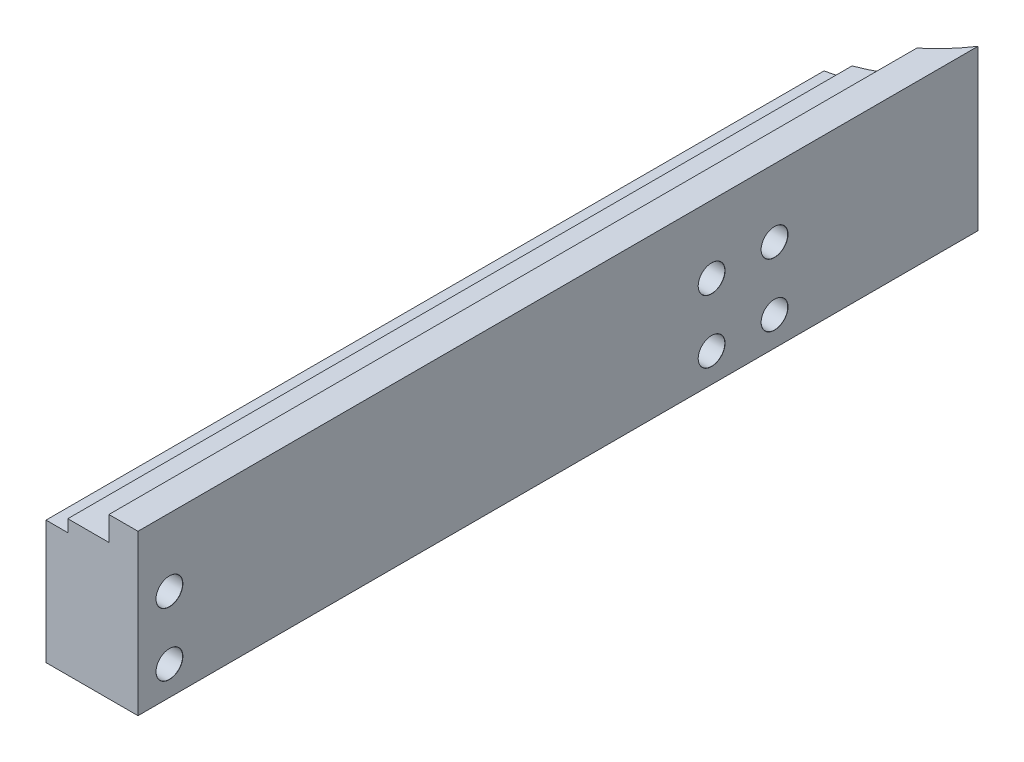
ISO-10303-21;
HEADER;
FILE_DESCRIPTION(('STEP AP214'),'2;1');
FILE_NAME('part.step','',(''),(''),'','','');
FILE_SCHEMA(('AUTOMOTIVE_DESIGN { 1 0 10303 214 1 1 1 1 }'));
ENDSEC;
DATA;
#1=APPLICATION_CONTEXT('core data for automotive mechanical design processes');
#2=APPLICATION_PROTOCOL_DEFINITION('international standard','automotive_design',2000,#1);
#3=PRODUCT_CONTEXT('',#1,'mechanical');
#4=PRODUCT('Part','Part','',(#3));
#5=PRODUCT_RELATED_PRODUCT_CATEGORY('part','',(#4));
#6=PRODUCT_DEFINITION_FORMATION('','',#4);
#7=PRODUCT_DEFINITION_CONTEXT('part definition',#1,'design');
#8=PRODUCT_DEFINITION('design','',#6,#7);
#9=PRODUCT_DEFINITION_SHAPE('','',#8);
#10=(LENGTH_UNIT() NAMED_UNIT(*) SI_UNIT(.MILLI.,.METRE.));
#11=(NAMED_UNIT(*) PLANE_ANGLE_UNIT() SI_UNIT($,.RADIAN.));
#12=(NAMED_UNIT(*) SI_UNIT($,.STERADIAN.) SOLID_ANGLE_UNIT());
#13=UNCERTAINTY_MEASURE_WITH_UNIT(LENGTH_MEASURE(1.E-05),#10,'distance_accuracy_value','');
#14=(GEOMETRIC_REPRESENTATION_CONTEXT(3) GLOBAL_UNCERTAINTY_ASSIGNED_CONTEXT((#13)) GLOBAL_UNIT_ASSIGNED_CONTEXT((#10,
#11,#12)) REPRESENTATION_CONTEXT('',''));
#15=CARTESIAN_POINT('',(0.,0.,0.));
#16=DIRECTION('',(0.,0.,1.));
#17=DIRECTION('',(1.,0.,0.));
#18=AXIS2_PLACEMENT_3D('',#15,#16,#17);
#19=CARTESIAN_POINT('',(-165.,251.054588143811,280.));
#20=DIRECTION('',(1.,0.,0.));
#21=DIRECTION('',(0.,0.,-1.));
#22=AXIS2_PLACEMENT_3D('',#19,#20,#21);
#23=PLANE('',#22);
#24=DIRECTION('',(0.,-1.,0.));
#25=VECTOR('',#24,1.);
#26=CARTESIAN_POINT('',(-165.,278.054588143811,113.109028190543));
#27=LINE('',#26,#25);
#28=CARTESIAN_POINT('',(-165.,251.054588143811,113.109028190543));
#29=VERTEX_POINT('',#28);
#30=CARTESIAN_POINT('',(-165.,246.05458814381,113.109028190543));
#31=VERTEX_POINT('',#30);
#32=EDGE_CURVE('E126',#29,#31,#27,.T.);
#33=ORIENTED_EDGE('',*,*,#32,.T.);
#34=DIRECTION('',(0.,0.,1.));
#35=VECTOR('',#34,1.);
#36=CARTESIAN_POINT('',(-165.,246.05458814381,113.109028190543));
#37=LINE('',#36,#35);
#38=CARTESIAN_POINT('',(-165.,246.05458814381,280.));
#39=VERTEX_POINT('',#38);
#40=EDGE_CURVE('E41',#31,#39,#37,.T.);
#41=ORIENTED_EDGE('',*,*,#40,.T.);
#42=DIRECTION('',(0.,-1.,0.));
#43=VECTOR('',#42,1.);
#44=CARTESIAN_POINT('',(-165.,251.054588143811,280.));
#45=LINE('',#44,#43);
#46=CARTESIAN_POINT('',(-165.,251.054588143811,280.));
#47=VERTEX_POINT('',#46);
#48=EDGE_CURVE('E133',#47,#39,#45,.T.);
#49=ORIENTED_EDGE('',*,*,#48,.F.);
#50=DIRECTION('',(0.,0.,-1.));
#51=VECTOR('',#50,1.);
#52=CARTESIAN_POINT('',(-165.,251.054588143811,280.));
#53=LINE('',#52,#51);
#54=EDGE_CURVE('E98',#47,#29,#53,.T.);
#55=ORIENTED_EDGE('',*,*,#54,.T.);
#56=EDGE_LOOP('',(#33,#41,#49,#55));
#57=FACE_BOUND('',#56,.T.);
#58=ADVANCED_FACE('F16',(#57),#23,.F.);
#59=CARTESIAN_POINT('',(-178.,218.05458814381,280.));
#60=DIRECTION('',(1.,0.,0.));
#61=DIRECTION('',(0.,0.,-1.));
#62=AXIS2_PLACEMENT_3D('',#59,#60,#61);
#63=PLANE('',#62);
#64=CARTESIAN_POINT('',(-178.,224.05458814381,273.5));
#65=DIRECTION('',(-1.,0.,0.));
#66=DIRECTION('',(0.,0.,1.));
#67=AXIS2_PLACEMENT_3D('',#64,#65,#66);
#68=CIRCLE('',#67,5.025);
#69=CARTESIAN_POINT('',(-178.,224.05458814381,278.525));
#70=VERTEX_POINT('',#69);
#71=EDGE_CURVE('E266',#70,#70,#68,.T.);
#72=ORIENTED_EDGE('',*,*,#71,.F.);
#73=EDGE_LOOP('',(#72));
#74=FACE_BOUND('',#73,.T.);
#75=CARTESIAN_POINT('',(-178.,237.05458814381,273.5));
#76=DIRECTION('',(-1.,0.,0.));
#77=DIRECTION('',(0.,0.,1.));
#78=AXIS2_PLACEMENT_3D('',#75,#76,#77);
#79=CIRCLE('',#78,5.025);
#80=CARTESIAN_POINT('',(-178.,237.05458814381,278.525));
#81=VERTEX_POINT('',#80);
#82=EDGE_CURVE('E245',#81,#81,#79,.T.);
#83=ORIENTED_EDGE('',*,*,#82,.F.);
#84=EDGE_LOOP('',(#83));
#85=FACE_BOUND('',#84,.T.);
#86=CARTESIAN_POINT('',(-178.,224.05458814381,161.5));
#87=DIRECTION('',(-1.,0.,0.));
#88=DIRECTION('',(0.,0.,1.));
#89=AXIS2_PLACEMENT_3D('',#86,#87,#88);
#90=CIRCLE('',#89,5.025);
#91=CARTESIAN_POINT('',(-178.,224.05458814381,166.525));
#92=VERTEX_POINT('',#91);
#93=EDGE_CURVE('E224',#92,#92,#90,.T.);
#94=ORIENTED_EDGE('',*,*,#93,.F.);
#95=EDGE_LOOP('',(#94));
#96=FACE_BOUND('',#95,.T.);
#97=CARTESIAN_POINT('',(-178.,224.05458814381,148.5));
#98=DIRECTION('',(-1.,0.,0.));
#99=DIRECTION('',(0.,0.,1.));
#100=AXIS2_PLACEMENT_3D('',#97,#98,#99);
#101=CIRCLE('',#100,5.025);
#102=CARTESIAN_POINT('',(-178.,224.05458814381,153.525));
#103=VERTEX_POINT('',#102);
#104=EDGE_CURVE('E203',#103,#103,#101,.T.);
#105=ORIENTED_EDGE('',*,*,#104,.F.);
#106=EDGE_LOOP('',(#105));
#107=FACE_BOUND('',#106,.T.);
#108=CARTESIAN_POINT('',(-178.,237.05458814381,161.5));
#109=DIRECTION('',(-1.,0.,0.));
#110=DIRECTION('',(0.,0.,1.));
#111=AXIS2_PLACEMENT_3D('',#108,#109,#110);
#112=CIRCLE('',#111,5.025);
#113=CARTESIAN_POINT('',(-178.,237.05458814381,166.525));
#114=VERTEX_POINT('',#113);
#115=EDGE_CURVE('E182',#114,#114,#112,.T.);
#116=ORIENTED_EDGE('',*,*,#115,.F.);
#117=EDGE_LOOP('',(#116));
#118=FACE_BOUND('',#117,.T.);
#119=CARTESIAN_POINT('',(-178.,237.05458814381,148.5));
#120=DIRECTION('',(-1.,0.,0.));
#121=DIRECTION('',(0.,0.,1.));
#122=AXIS2_PLACEMENT_3D('',#119,#120,#121);
#123=CIRCLE('',#122,5.025);
#124=CARTESIAN_POINT('',(-178.,237.05458814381,153.525));
#125=VERTEX_POINT('',#124);
#126=EDGE_CURVE('E161',#125,#125,#123,.T.);
#127=ORIENTED_EDGE('',*,*,#126,.F.);
#128=EDGE_LOOP('',(#127));
#129=FACE_BOUND('',#128,.T.);
#130=DIRECTION('',(0.,0.,-1.));
#131=VECTOR('',#130,1.);
#132=CARTESIAN_POINT('',(-178.,243.55458814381,280.));
#133=LINE('',#132,#131);
#134=CARTESIAN_POINT('',(-178.,243.55458814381,280.));
#135=VERTEX_POINT('',#134);
#136=CARTESIAN_POINT('',(-178.,243.55458814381,119.286531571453));
#137=VERTEX_POINT('',#136);
#138=EDGE_CURVE('E124',#135,#137,#133,.T.);
#139=ORIENTED_EDGE('',*,*,#138,.T.);
#140=DIRECTION('',(0.,-1.,0.));
#141=VECTOR('',#140,1.);
#142=CARTESIAN_POINT('',(-178.,278.054588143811,119.286531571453));
#143=LINE('',#142,#141);
#144=CARTESIAN_POINT('',(-178.,218.05458814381,119.286531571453));
#145=VERTEX_POINT('',#144);
#146=EDGE_CURVE('E101',#137,#145,#143,.T.);
#147=ORIENTED_EDGE('',*,*,#146,.T.);
#148=DIRECTION('',(0.,0.,-1.));
#149=VECTOR('',#148,1.);
#150=CARTESIAN_POINT('',(-178.,218.05458814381,280.));
#151=LINE('',#150,#149);
#152=CARTESIAN_POINT('',(-178.,218.05458814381,280.));
#153=VERTEX_POINT('',#152);
#154=EDGE_CURVE('E121',#153,#145,#151,.T.);
#155=ORIENTED_EDGE('',*,*,#154,.F.);
#156=DIRECTION('',(0.,-1.,0.));
#157=VECTOR('',#156,1.);
#158=CARTESIAN_POINT('',(-178.,218.05458814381,280.));
#159=LINE('',#158,#157);
#160=EDGE_CURVE('E25',#135,#153,#159,.T.);
#161=ORIENTED_EDGE('',*,*,#160,.F.);
#162=EDGE_LOOP('',(#139,#147,#155,#161));
#163=FACE_BOUND('',#162,.T.);
#164=ADVANCED_FACE('F313',(#74,#85,#96,#107,#118,#129,#163),#63,.F.);
#165=CARTESIAN_POINT('',(-159.,218.05458814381,280.));
#166=DIRECTION('',(0.,1.,0.));
#167=DIRECTION('',(0.,0.,1.));
#168=AXIS2_PLACEMENT_3D('',#165,#166,#167);
#169=PLANE('',#168);
#170=ORIENTED_EDGE('',*,*,#154,.T.);
#171=CARTESIAN_POINT('',(-184.,218.05458814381,89.8926546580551));
#172=DIRECTION('',(0.,1.,0.));
#173=DIRECTION('',(0.,0.,1.));
#174=AXIS2_PLACEMENT_3D('',#171,#172,#173);
#175=CIRCLE('',#174,30.);
#176=CARTESIAN_POINT('',(-159.,218.05458814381,106.475778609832));
#177=VERTEX_POINT('',#176);
#178=EDGE_CURVE('E120',#145,#177,#175,.T.);
#179=ORIENTED_EDGE('',*,*,#178,.T.);
#180=DIRECTION('',(0.,0.,-1.));
#181=VECTOR('',#180,1.);
#182=CARTESIAN_POINT('',(-159.,218.05458814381,280.));
#183=LINE('',#182,#181);
#184=CARTESIAN_POINT('',(-159.,218.05458814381,280.));
#185=VERTEX_POINT('',#184);
#186=EDGE_CURVE('E117',#185,#177,#183,.T.);
#187=ORIENTED_EDGE('',*,*,#186,.F.);
#188=DIRECTION('',(1.,0.,0.));
#189=VECTOR('',#188,1.);
#190=CARTESIAN_POINT('',(-159.,218.05458814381,280.));
#191=LINE('',#190,#189);
#192=EDGE_CURVE('E11',#153,#185,#191,.T.);
#193=ORIENTED_EDGE('',*,*,#192,.F.);
#194=EDGE_LOOP('',(#170,#179,#187,#193));
#195=FACE_BOUND('',#194,.T.);
#196=ADVANCED_FACE('F316',(#195),#169,.F.);
#197=CARTESIAN_POINT('',(-159.,218.05458814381,280.));
#198=DIRECTION('',(-1.,0.,0.));
#199=DIRECTION('',(0.,0.,1.));
#200=AXIS2_PLACEMENT_3D('',#197,#198,#199);
#201=PLANE('',#200);
#202=CARTESIAN_POINT('',(-159.,224.05458814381,273.5));
#203=DIRECTION('',(-1.,0.,0.));
#204=DIRECTION('',(0.,0.,1.));
#205=AXIS2_PLACEMENT_3D('',#202,#203,#204);
#206=CIRCLE('',#205,2.775);
#207=CARTESIAN_POINT('',(-159.,224.05458814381,276.275));
#208=VERTEX_POINT('',#207);
#209=EDGE_CURVE('E269',#208,#208,#206,.T.);
#210=ORIENTED_EDGE('',*,*,#209,.T.);
#211=EDGE_LOOP('',(#210));
#212=FACE_BOUND('',#211,.T.);
#213=CARTESIAN_POINT('',(-159.,237.05458814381,273.5));
#214=DIRECTION('',(-1.,0.,0.));
#215=DIRECTION('',(0.,0.,1.));
#216=AXIS2_PLACEMENT_3D('',#213,#214,#215);
#217=CIRCLE('',#216,2.775);
#218=CARTESIAN_POINT('',(-159.,237.05458814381,276.275));
#219=VERTEX_POINT('',#218);
#220=EDGE_CURVE('E248',#219,#219,#217,.T.);
#221=ORIENTED_EDGE('',*,*,#220,.T.);
#222=EDGE_LOOP('',(#221));
#223=FACE_BOUND('',#222,.T.);
#224=CARTESIAN_POINT('',(-159.,224.05458814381,161.5));
#225=DIRECTION('',(-1.,0.,0.));
#226=DIRECTION('',(0.,0.,1.));
#227=AXIS2_PLACEMENT_3D('',#224,#225,#226);
#228=CIRCLE('',#227,2.775);
#229=CARTESIAN_POINT('',(-159.,224.05458814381,164.275));
#230=VERTEX_POINT('',#229);
#231=EDGE_CURVE('E227',#230,#230,#228,.T.);
#232=ORIENTED_EDGE('',*,*,#231,.T.);
#233=EDGE_LOOP('',(#232));
#234=FACE_BOUND('',#233,.T.);
#235=CARTESIAN_POINT('',(-159.,224.05458814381,148.5));
#236=DIRECTION('',(-1.,0.,0.));
#237=DIRECTION('',(0.,0.,1.));
#238=AXIS2_PLACEMENT_3D('',#235,#236,#237);
#239=CIRCLE('',#238,2.775);
#240=CARTESIAN_POINT('',(-159.,224.05458814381,151.275));
#241=VERTEX_POINT('',#240);
#242=EDGE_CURVE('E206',#241,#241,#239,.T.);
#243=ORIENTED_EDGE('',*,*,#242,.T.);
#244=EDGE_LOOP('',(#243));
#245=FACE_BOUND('',#244,.T.);
#246=CARTESIAN_POINT('',(-159.,237.05458814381,161.5));
#247=DIRECTION('',(-1.,0.,0.));
#248=DIRECTION('',(0.,0.,1.));
#249=AXIS2_PLACEMENT_3D('',#246,#247,#248);
#250=CIRCLE('',#249,2.775);
#251=CARTESIAN_POINT('',(-159.,237.05458814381,164.275));
#252=VERTEX_POINT('',#251);
#253=EDGE_CURVE('E185',#252,#252,#250,.T.);
#254=ORIENTED_EDGE('',*,*,#253,.T.);
#255=EDGE_LOOP('',(#254));
#256=FACE_BOUND('',#255,.T.);
#257=CARTESIAN_POINT('',(-159.,237.05458814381,148.5));
#258=DIRECTION('',(-1.,0.,0.));
#259=DIRECTION('',(0.,0.,1.));
#260=AXIS2_PLACEMENT_3D('',#257,#258,#259);
#261=CIRCLE('',#260,2.775);
#262=CARTESIAN_POINT('',(-159.,237.05458814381,151.275));
#263=VERTEX_POINT('',#262);
#264=EDGE_CURVE('E164',#263,#263,#261,.T.);
#265=ORIENTED_EDGE('',*,*,#264,.T.);
#266=EDGE_LOOP('',(#265));
#267=FACE_BOUND('',#266,.T.);
#268=ORIENTED_EDGE('',*,*,#186,.T.);
#269=DIRECTION('',(0.,-1.,0.));
#270=VECTOR('',#269,1.);
#271=CARTESIAN_POINT('',(-159.,278.054588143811,106.475778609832));
#272=LINE('',#271,#270);
#273=CARTESIAN_POINT('',(-159.,251.054588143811,106.475778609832));
#274=VERTEX_POINT('',#273);
#275=EDGE_CURVE('E114',#177,#274,#272,.F.);
#276=ORIENTED_EDGE('',*,*,#275,.T.);
#277=DIRECTION('',(0.,0.,-1.));
#278=VECTOR('',#277,1.);
#279=CARTESIAN_POINT('',(-159.,251.054588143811,280.));
#280=LINE('',#279,#278);
#281=CARTESIAN_POINT('',(-159.,251.054588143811,280.));
#282=VERTEX_POINT('',#281);
#283=EDGE_CURVE('E109',#282,#274,#280,.T.);
#284=ORIENTED_EDGE('',*,*,#283,.F.);
#285=DIRECTION('',(0.,1.,0.));
#286=VECTOR('',#285,1.);
#287=CARTESIAN_POINT('',(-159.,218.05458814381,280.));
#288=LINE('',#287,#286);
#289=EDGE_CURVE('E103',#185,#282,#288,.T.);
#290=ORIENTED_EDGE('',*,*,#289,.F.);
#291=EDGE_LOOP('',(#268,#276,#284,#290));
#292=FACE_BOUND('',#291,.T.);
#293=ADVANCED_FACE('F273',(#212,#223,#234,#245,#256,#267,#292),#201,.F.);
#294=CARTESIAN_POINT('',(-159.,251.054588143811,280.));
#295=DIRECTION('',(0.,-1.,0.));
#296=DIRECTION('',(0.,0.,-1.));
#297=AXIS2_PLACEMENT_3D('',#294,#295,#296);
#298=PLANE('',#297);
#299=ORIENTED_EDGE('',*,*,#283,.T.);
#300=CARTESIAN_POINT('',(-184.,251.054588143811,89.8926546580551));
#301=DIRECTION('',(0.,-1.,0.));
#302=DIRECTION('',(0.,0.,-1.));
#303=AXIS2_PLACEMENT_3D('',#300,#301,#302);
#304=CIRCLE('',#303,30.);
#305=EDGE_CURVE('E104',#274,#29,#304,.T.);
#306=ORIENTED_EDGE('',*,*,#305,.T.);
#307=ORIENTED_EDGE('',*,*,#54,.F.);
#308=DIRECTION('',(-1.,0.,0.));
#309=VECTOR('',#308,1.);
#310=CARTESIAN_POINT('',(-159.,251.054588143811,280.));
#311=LINE('',#310,#309);
#312=EDGE_CURVE('E106',#282,#47,#311,.T.);
#313=ORIENTED_EDGE('',*,*,#312,.F.);
#314=EDGE_LOOP('',(#299,#306,#307,#313));
#315=FACE_BOUND('',#314,.T.);
#316=ADVANCED_FACE('F337',(#315),#298,.F.);
#317=CARTESIAN_POINT('',(-178.,243.55458814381,280.));
#318=DIRECTION('',(0.,-1.,0.));
#319=DIRECTION('',(0.,0.,-1.));
#320=AXIS2_PLACEMENT_3D('',#317,#318,#319);
#321=PLANE('',#320);
#322=DIRECTION('',(-1.,0.,0.));
#323=VECTOR('',#322,1.);
#324=CARTESIAN_POINT('',(-178.,243.55458814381,280.));
#325=LINE('',#324,#323);
#326=CARTESIAN_POINT('',(-173.5,243.55458814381,280.));
#327=VERTEX_POINT('',#326);
#328=EDGE_CURVE('E33',#327,#135,#325,.T.);
#329=ORIENTED_EDGE('',*,*,#328,.F.);
#330=DIRECTION('',(0.,0.,1.));
#331=VECTOR('',#330,1.);
#332=CARTESIAN_POINT('',(-173.5,243.55458814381,113.109028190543));
#333=LINE('',#332,#331);
#334=CARTESIAN_POINT('',(-173.5,243.55458814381,117.995145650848));
#335=VERTEX_POINT('',#334);
#336=EDGE_CURVE('E87',#335,#327,#333,.T.);
#337=ORIENTED_EDGE('',*,*,#336,.F.);
#338=CARTESIAN_POINT('',(-184.,243.55458814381,89.8926546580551));
#339=DIRECTION('',(0.,-1.,0.));
#340=DIRECTION('',(0.,0.,-1.));
#341=AXIS2_PLACEMENT_3D('',#338,#339,#340);
#342=CIRCLE('',#341,30.);
#343=EDGE_CURVE('E20',#335,#137,#342,.T.);
#344=ORIENTED_EDGE('',*,*,#343,.T.);
#345=ORIENTED_EDGE('',*,*,#138,.F.);
#346=EDGE_LOOP('',(#329,#337,#344,#345));
#347=FACE_BOUND('',#346,.T.);
#348=ADVANCED_FACE('F96',(#347),#321,.F.);
#349=CARTESIAN_POINT('',(0.,0.,280.));
#350=DIRECTION('',(0.,0.,1.));
#351=DIRECTION('',(1.,0.,0.));
#352=AXIS2_PLACEMENT_3D('',#349,#350,#351);
#353=PLANE('',#352);
#354=ORIENTED_EDGE('',*,*,#48,.T.);
#355=DIRECTION('',(-1.,0.,0.));
#356=VECTOR('',#355,1.);
#357=CARTESIAN_POINT('',(-165.,246.05458814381,280.));
#358=LINE('',#357,#356);
#359=CARTESIAN_POINT('',(-173.5,246.05458814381,280.));
#360=VERTEX_POINT('',#359);
#361=EDGE_CURVE('E143',#39,#360,#358,.T.);
#362=ORIENTED_EDGE('',*,*,#361,.T.);
#363=DIRECTION('',(0.,-1.,0.));
#364=VECTOR('',#363,1.);
#365=CARTESIAN_POINT('',(-173.5,243.55458814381,280.));
#366=LINE('',#365,#364);
#367=EDGE_CURVE('E140',#360,#327,#366,.T.);
#368=ORIENTED_EDGE('',*,*,#367,.T.);
#369=ORIENTED_EDGE('',*,*,#328,.T.);
#370=ORIENTED_EDGE('',*,*,#160,.T.);
#371=ORIENTED_EDGE('',*,*,#192,.T.);
#372=ORIENTED_EDGE('',*,*,#289,.T.);
#373=ORIENTED_EDGE('',*,*,#312,.T.);
#374=EDGE_LOOP('',(#354,#362,#368,#369,#370,#371,#372,#373));
#375=FACE_BOUND('',#374,.T.);
#376=ADVANCED_FACE('F332',(#375),#353,.T.);
#377=CARTESIAN_POINT('',(-184.,278.054588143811,89.8926546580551));
#378=DIRECTION('',(0.,-1.,0.));
#379=DIRECTION('',(0.,0.,-1.));
#380=AXIS2_PLACEMENT_3D('',#377,#378,#379);
#381=CYLINDRICAL_SURFACE('',#380,30.);
#382=ORIENTED_EDGE('',*,*,#343,.F.);
#383=DIRECTION('',(0.,-1.,0.));
#384=VECTOR('',#383,1.);
#385=CARTESIAN_POINT('',(-173.5,251.054588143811,117.995145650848));
#386=LINE('',#385,#384);
#387=CARTESIAN_POINT('',(-173.5,246.05458814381,117.995145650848));
#388=VERTEX_POINT('',#387);
#389=EDGE_CURVE('E84',#388,#335,#386,.T.);
#390=ORIENTED_EDGE('',*,*,#389,.F.);
#391=CARTESIAN_POINT('',(-184.,246.05458814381,89.8926546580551));
#392=DIRECTION('',(0.,1.,0.));
#393=DIRECTION('',(0.,0.,1.));
#394=AXIS2_PLACEMENT_3D('',#391,#392,#393);
#395=CIRCLE('',#394,30.);
#396=EDGE_CURVE('E93',#388,#31,#395,.T.);
#397=ORIENTED_EDGE('',*,*,#396,.T.);
#398=ORIENTED_EDGE('',*,*,#32,.F.);
#399=ORIENTED_EDGE('',*,*,#305,.F.);
#400=ORIENTED_EDGE('',*,*,#275,.F.);
#401=ORIENTED_EDGE('',*,*,#178,.F.);
#402=ORIENTED_EDGE('',*,*,#146,.F.);
#403=EDGE_LOOP('',(#382,#390,#397,#398,#399,#400,#401,#402));
#404=FACE_BOUND('',#403,.T.);
#405=ADVANCED_FACE('F18',(#404),#381,.F.);
#406=CARTESIAN_POINT('',(-173.5,243.55458814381,113.109028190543));
#407=DIRECTION('',(-1.,0.,0.));
#408=DIRECTION('',(0.,0.,1.));
#409=AXIS2_PLACEMENT_3D('',#406,#407,#408);
#410=PLANE('',#409);
#411=ORIENTED_EDGE('',*,*,#389,.T.);
#412=ORIENTED_EDGE('',*,*,#336,.T.);
#413=ORIENTED_EDGE('',*,*,#367,.F.);
#414=DIRECTION('',(0.,0.,1.));
#415=VECTOR('',#414,1.);
#416=CARTESIAN_POINT('',(-173.5,246.05458814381,113.109028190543));
#417=LINE('',#416,#415);
#418=EDGE_CURVE('E89',#388,#360,#417,.T.);
#419=ORIENTED_EDGE('',*,*,#418,.F.);
#420=EDGE_LOOP('',(#411,#412,#413,#419));
#421=FACE_BOUND('',#420,.T.);
#422=ADVANCED_FACE('F85',(#421),#410,.T.);
#423=CARTESIAN_POINT('',(-165.,246.05458814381,113.109028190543));
#424=DIRECTION('',(0.,1.,0.));
#425=DIRECTION('',(0.,0.,1.));
#426=AXIS2_PLACEMENT_3D('',#423,#424,#425);
#427=PLANE('',#426);
#428=ORIENTED_EDGE('',*,*,#396,.F.);
#429=ORIENTED_EDGE('',*,*,#418,.T.);
#430=ORIENTED_EDGE('',*,*,#361,.F.);
#431=ORIENTED_EDGE('',*,*,#40,.F.);
#432=EDGE_LOOP('',(#428,#429,#430,#431));
#433=FACE_BOUND('',#432,.T.);
#434=ADVANCED_FACE('F336',(#433),#427,.T.);
#435=CARTESIAN_POINT('',(-159.025,237.05458814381,148.5));
#436=DIRECTION('',(1.,0.,0.));
#437=DIRECTION('',(0.,0.,-1.));
#438=AXIS2_PLACEMENT_3D('',#435,#436,#437);
#439=CONICAL_SURFACE('',#438,2.75,0.785398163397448);
#440=ORIENTED_EDGE('',*,*,#264,.F.);
#441=EDGE_LOOP('',(#440));
#442=FACE_BOUND('',#441,.T.);
#443=CARTESIAN_POINT('',(-159.025,237.05458814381,148.5));
#444=DIRECTION('',(-1.,0.,0.));
#445=DIRECTION('',(0.,0.,1.));
#446=AXIS2_PLACEMENT_3D('',#443,#444,#445);
#447=CIRCLE('',#446,2.75);
#448=CARTESIAN_POINT('',(-159.025,237.05458814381,151.25));
#449=VERTEX_POINT('',#448);
#450=EDGE_CURVE('E94',#449,#449,#447,.T.);
#451=ORIENTED_EDGE('',*,*,#450,.T.);
#452=EDGE_LOOP('',(#451));
#453=FACE_BOUND('',#452,.T.);
#454=ADVANCED_FACE('F373',(#442,#453),#439,.F.);
#455=CARTESIAN_POINT('',(-178.,237.05458814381,148.5));
#456=DIRECTION('',(-1.,0.,0.));
#457=DIRECTION('',(0.,0.,1.));
#458=AXIS2_PLACEMENT_3D('',#455,#456,#457);
#459=CYLINDRICAL_SURFACE('',#458,2.75);
#460=ORIENTED_EDGE('',*,*,#450,.F.);
#461=EDGE_LOOP('',(#460));
#462=FACE_BOUND('',#461,.T.);
#463=CARTESIAN_POINT('',(-172.275,237.05458814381,148.5));
#464=DIRECTION('',(-1.,0.,0.));
#465=DIRECTION('',(0.,0.,1.));
#466=AXIS2_PLACEMENT_3D('',#463,#464,#465);
#467=CIRCLE('',#466,2.75);
#468=CARTESIAN_POINT('',(-172.275,237.05458814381,151.25));
#469=VERTEX_POINT('',#468);
#470=EDGE_CURVE('E149',#469,#469,#467,.T.);
#471=ORIENTED_EDGE('',*,*,#470,.T.);
#472=EDGE_LOOP('',(#471));
#473=FACE_BOUND('',#472,.T.);
#474=ADVANCED_FACE('F378',(#462,#473),#459,.F.);
#475=CARTESIAN_POINT('',(-172.3,237.05458814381,148.5));
#476=DIRECTION('',(-1.,0.,0.));
#477=DIRECTION('',(0.,0.,1.));
#478=AXIS2_PLACEMENT_3D('',#475,#476,#477);
#479=CONICAL_SURFACE('',#478,2.775,0.785398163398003);
#480=ORIENTED_EDGE('',*,*,#470,.F.);
#481=EDGE_LOOP('',(#480));
#482=FACE_BOUND('',#481,.T.);
#483=CARTESIAN_POINT('',(-172.3,237.05458814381,148.5));
#484=DIRECTION('',(-1.,0.,0.));
#485=DIRECTION('',(0.,0.,1.));
#486=AXIS2_PLACEMENT_3D('',#483,#484,#485);
#487=CIRCLE('',#486,2.775);
#488=CARTESIAN_POINT('',(-172.3,237.05458814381,151.275));
#489=VERTEX_POINT('',#488);
#490=EDGE_CURVE('E152',#489,#489,#487,.T.);
#491=ORIENTED_EDGE('',*,*,#490,.T.);
#492=EDGE_LOOP('',(#491));
#493=FACE_BOUND('',#492,.T.);
#494=ADVANCED_FACE('F382',(#482,#493),#479,.F.);
#495=CARTESIAN_POINT('',(-172.3,239.82958814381,148.5));
#496=DIRECTION('',(1.,0.,0.));
#497=DIRECTION('',(0.,0.,-1.));
#498=AXIS2_PLACEMENT_3D('',#495,#496,#497);
#499=PLANE('',#498);
#500=ORIENTED_EDGE('',*,*,#490,.F.);
#501=EDGE_LOOP('',(#500));
#502=FACE_BOUND('',#501,.T.);
#503=CARTESIAN_POINT('',(-172.3,237.05458814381,148.5));
#504=DIRECTION('',(-1.,0.,0.));
#505=DIRECTION('',(0.,0.,1.));
#506=AXIS2_PLACEMENT_3D('',#503,#504,#505);
#507=CIRCLE('',#506,5.);
#508=CARTESIAN_POINT('',(-172.3,237.05458814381,153.5));
#509=VERTEX_POINT('',#508);
#510=EDGE_CURVE('E155',#509,#509,#507,.T.);
#511=ORIENTED_EDGE('',*,*,#510,.T.);
#512=EDGE_LOOP('',(#511));
#513=FACE_BOUND('',#512,.T.);
#514=ADVANCED_FACE('F386',(#502,#513),#499,.F.);
#515=CARTESIAN_POINT('',(-178.,237.05458814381,148.5));
#516=DIRECTION('',(-1.,0.,0.));
#517=DIRECTION('',(0.,0.,1.));
#518=AXIS2_PLACEMENT_3D('',#515,#516,#517);
#519=CYLINDRICAL_SURFACE('',#518,5.);
#520=ORIENTED_EDGE('',*,*,#510,.F.);
#521=EDGE_LOOP('',(#520));
#522=FACE_BOUND('',#521,.T.);
#523=CARTESIAN_POINT('',(-177.975,237.05458814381,148.5));
#524=DIRECTION('',(-1.,0.,0.));
#525=DIRECTION('',(0.,0.,1.));
#526=AXIS2_PLACEMENT_3D('',#523,#524,#525);
#527=CIRCLE('',#526,5.);
#528=CARTESIAN_POINT('',(-177.975,237.05458814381,153.5));
#529=VERTEX_POINT('',#528);
#530=EDGE_CURVE('E158',#529,#529,#527,.T.);
#531=ORIENTED_EDGE('',*,*,#530,.T.);
#532=EDGE_LOOP('',(#531));
#533=FACE_BOUND('',#532,.T.);
#534=ADVANCED_FACE('F390',(#522,#533),#519,.F.);
#535=CARTESIAN_POINT('',(-178.,237.05458814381,148.5));
#536=DIRECTION('',(-1.,0.,0.));
#537=DIRECTION('',(0.,0.,1.));
#538=AXIS2_PLACEMENT_3D('',#535,#536,#537);
#539=CONICAL_SURFACE('',#538,5.025,0.785398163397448);
#540=ORIENTED_EDGE('',*,*,#530,.F.);
#541=EDGE_LOOP('',(#540));
#542=FACE_BOUND('',#541,.T.);
#543=ORIENTED_EDGE('',*,*,#126,.T.);
#544=EDGE_LOOP('',(#543));
#545=FACE_BOUND('',#544,.T.);
#546=ADVANCED_FACE('F394',(#542,#545),#539,.F.);
#547=CARTESIAN_POINT('',(-159.025,237.05458814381,161.5));
#548=DIRECTION('',(1.,0.,0.));
#549=DIRECTION('',(0.,0.,-1.));
#550=AXIS2_PLACEMENT_3D('',#547,#548,#549);
#551=CONICAL_SURFACE('',#550,2.75,0.785398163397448);
#552=ORIENTED_EDGE('',*,*,#253,.F.);
#553=EDGE_LOOP('',(#552));
#554=FACE_BOUND('',#553,.T.);
#555=CARTESIAN_POINT('',(-159.025,237.05458814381,161.5));
#556=DIRECTION('',(-1.,0.,0.));
#557=DIRECTION('',(0.,0.,1.));
#558=AXIS2_PLACEMENT_3D('',#555,#556,#557);
#559=CIRCLE('',#558,2.75);
#560=CARTESIAN_POINT('',(-159.025,237.05458814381,164.25));
#561=VERTEX_POINT('',#560);
#562=EDGE_CURVE('E167',#561,#561,#559,.T.);
#563=ORIENTED_EDGE('',*,*,#562,.T.);
#564=EDGE_LOOP('',(#563));
#565=FACE_BOUND('',#564,.T.);
#566=ADVANCED_FACE('F398',(#554,#565),#551,.F.);
#567=CARTESIAN_POINT('',(-178.,237.05458814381,161.5));
#568=DIRECTION('',(-1.,0.,0.));
#569=DIRECTION('',(0.,0.,1.));
#570=AXIS2_PLACEMENT_3D('',#567,#568,#569);
#571=CYLINDRICAL_SURFACE('',#570,2.75);
#572=ORIENTED_EDGE('',*,*,#562,.F.);
#573=EDGE_LOOP('',(#572));
#574=FACE_BOUND('',#573,.T.);
#575=CARTESIAN_POINT('',(-172.275,237.05458814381,161.5));
#576=DIRECTION('',(-1.,0.,0.));
#577=DIRECTION('',(0.,0.,1.));
#578=AXIS2_PLACEMENT_3D('',#575,#576,#577);
#579=CIRCLE('',#578,2.75);
#580=CARTESIAN_POINT('',(-172.275,237.05458814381,164.25));
#581=VERTEX_POINT('',#580);
#582=EDGE_CURVE('E170',#581,#581,#579,.T.);
#583=ORIENTED_EDGE('',*,*,#582,.T.);
#584=EDGE_LOOP('',(#583));
#585=FACE_BOUND('',#584,.T.);
#586=ADVANCED_FACE('F402',(#574,#585),#571,.F.);
#587=CARTESIAN_POINT('',(-172.3,237.05458814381,161.5));
#588=DIRECTION('',(-1.,0.,0.));
#589=DIRECTION('',(0.,0.,1.));
#590=AXIS2_PLACEMENT_3D('',#587,#588,#589);
#591=CONICAL_SURFACE('',#590,2.775,0.785398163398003);
#592=ORIENTED_EDGE('',*,*,#582,.F.);
#593=EDGE_LOOP('',(#592));
#594=FACE_BOUND('',#593,.T.);
#595=CARTESIAN_POINT('',(-172.3,237.05458814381,161.5));
#596=DIRECTION('',(-1.,0.,0.));
#597=DIRECTION('',(0.,0.,1.));
#598=AXIS2_PLACEMENT_3D('',#595,#596,#597);
#599=CIRCLE('',#598,2.775);
#600=CARTESIAN_POINT('',(-172.3,237.05458814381,164.275));
#601=VERTEX_POINT('',#600);
#602=EDGE_CURVE('E173',#601,#601,#599,.T.);
#603=ORIENTED_EDGE('',*,*,#602,.T.);
#604=EDGE_LOOP('',(#603));
#605=FACE_BOUND('',#604,.T.);
#606=ADVANCED_FACE('F406',(#594,#605),#591,.F.);
#607=CARTESIAN_POINT('',(-172.3,239.82958814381,161.5));
#608=DIRECTION('',(1.,0.,0.));
#609=DIRECTION('',(0.,0.,-1.));
#610=AXIS2_PLACEMENT_3D('',#607,#608,#609);
#611=PLANE('',#610);
#612=ORIENTED_EDGE('',*,*,#602,.F.);
#613=EDGE_LOOP('',(#612));
#614=FACE_BOUND('',#613,.T.);
#615=CARTESIAN_POINT('',(-172.3,237.05458814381,161.5));
#616=DIRECTION('',(-1.,0.,0.));
#617=DIRECTION('',(0.,0.,1.));
#618=AXIS2_PLACEMENT_3D('',#615,#616,#617);
#619=CIRCLE('',#618,5.);
#620=CARTESIAN_POINT('',(-172.3,237.05458814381,166.5));
#621=VERTEX_POINT('',#620);
#622=EDGE_CURVE('E176',#621,#621,#619,.T.);
#623=ORIENTED_EDGE('',*,*,#622,.T.);
#624=EDGE_LOOP('',(#623));
#625=FACE_BOUND('',#624,.T.);
#626=ADVANCED_FACE('F410',(#614,#625),#611,.F.);
#627=CARTESIAN_POINT('',(-178.,237.05458814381,161.5));
#628=DIRECTION('',(-1.,0.,0.));
#629=DIRECTION('',(0.,0.,1.));
#630=AXIS2_PLACEMENT_3D('',#627,#628,#629);
#631=CYLINDRICAL_SURFACE('',#630,5.);
#632=ORIENTED_EDGE('',*,*,#622,.F.);
#633=EDGE_LOOP('',(#632));
#634=FACE_BOUND('',#633,.T.);
#635=CARTESIAN_POINT('',(-177.975,237.05458814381,161.5));
#636=DIRECTION('',(-1.,0.,0.));
#637=DIRECTION('',(0.,0.,1.));
#638=AXIS2_PLACEMENT_3D('',#635,#636,#637);
#639=CIRCLE('',#638,5.);
#640=CARTESIAN_POINT('',(-177.975,237.05458814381,166.5));
#641=VERTEX_POINT('',#640);
#642=EDGE_CURVE('E179',#641,#641,#639,.T.);
#643=ORIENTED_EDGE('',*,*,#642,.T.);
#644=EDGE_LOOP('',(#643));
#645=FACE_BOUND('',#644,.T.);
#646=ADVANCED_FACE('F414',(#634,#645),#631,.F.);
#647=CARTESIAN_POINT('',(-178.,237.05458814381,161.5));
#648=DIRECTION('',(-1.,0.,0.));
#649=DIRECTION('',(0.,0.,1.));
#650=AXIS2_PLACEMENT_3D('',#647,#648,#649);
#651=CONICAL_SURFACE('',#650,5.025,0.785398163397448);
#652=ORIENTED_EDGE('',*,*,#642,.F.);
#653=EDGE_LOOP('',(#652));
#654=FACE_BOUND('',#653,.T.);
#655=ORIENTED_EDGE('',*,*,#115,.T.);
#656=EDGE_LOOP('',(#655));
#657=FACE_BOUND('',#656,.T.);
#658=ADVANCED_FACE('F418',(#654,#657),#651,.F.);
#659=CARTESIAN_POINT('',(-159.025,224.05458814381,148.5));
#660=DIRECTION('',(1.,0.,0.));
#661=DIRECTION('',(0.,0.,-1.));
#662=AXIS2_PLACEMENT_3D('',#659,#660,#661);
#663=CONICAL_SURFACE('',#662,2.75,0.785398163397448);
#664=ORIENTED_EDGE('',*,*,#242,.F.);
#665=EDGE_LOOP('',(#664));
#666=FACE_BOUND('',#665,.T.);
#667=CARTESIAN_POINT('',(-159.025,224.05458814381,148.5));
#668=DIRECTION('',(-1.,0.,0.));
#669=DIRECTION('',(0.,0.,1.));
#670=AXIS2_PLACEMENT_3D('',#667,#668,#669);
#671=CIRCLE('',#670,2.75);
#672=CARTESIAN_POINT('',(-159.025,224.05458814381,151.25));
#673=VERTEX_POINT('',#672);
#674=EDGE_CURVE('E188',#673,#673,#671,.T.);
#675=ORIENTED_EDGE('',*,*,#674,.T.);
#676=EDGE_LOOP('',(#675));
#677=FACE_BOUND('',#676,.T.);
#678=ADVANCED_FACE('F422',(#666,#677),#663,.F.);
#679=CARTESIAN_POINT('',(-178.,224.05458814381,148.5));
#680=DIRECTION('',(-1.,0.,0.));
#681=DIRECTION('',(0.,0.,1.));
#682=AXIS2_PLACEMENT_3D('',#679,#680,#681);
#683=CYLINDRICAL_SURFACE('',#682,2.75);
#684=ORIENTED_EDGE('',*,*,#674,.F.);
#685=EDGE_LOOP('',(#684));
#686=FACE_BOUND('',#685,.T.);
#687=CARTESIAN_POINT('',(-172.275,224.05458814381,148.5));
#688=DIRECTION('',(-1.,0.,0.));
#689=DIRECTION('',(0.,0.,1.));
#690=AXIS2_PLACEMENT_3D('',#687,#688,#689);
#691=CIRCLE('',#690,2.75);
#692=CARTESIAN_POINT('',(-172.275,224.05458814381,151.25));
#693=VERTEX_POINT('',#692);
#694=EDGE_CURVE('E191',#693,#693,#691,.T.);
#695=ORIENTED_EDGE('',*,*,#694,.T.);
#696=EDGE_LOOP('',(#695));
#697=FACE_BOUND('',#696,.T.);
#698=ADVANCED_FACE('F426',(#686,#697),#683,.F.);
#699=CARTESIAN_POINT('',(-172.3,224.05458814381,148.5));
#700=DIRECTION('',(-1.,0.,0.));
#701=DIRECTION('',(0.,0.,1.));
#702=AXIS2_PLACEMENT_3D('',#699,#700,#701);
#703=CONICAL_SURFACE('',#702,2.775,0.785398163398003);
#704=ORIENTED_EDGE('',*,*,#694,.F.);
#705=EDGE_LOOP('',(#704));
#706=FACE_BOUND('',#705,.T.);
#707=CARTESIAN_POINT('',(-172.3,224.05458814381,148.5));
#708=DIRECTION('',(-1.,0.,0.));
#709=DIRECTION('',(0.,0.,1.));
#710=AXIS2_PLACEMENT_3D('',#707,#708,#709);
#711=CIRCLE('',#710,2.775);
#712=CARTESIAN_POINT('',(-172.3,224.05458814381,151.275));
#713=VERTEX_POINT('',#712);
#714=EDGE_CURVE('E194',#713,#713,#711,.T.);
#715=ORIENTED_EDGE('',*,*,#714,.T.);
#716=EDGE_LOOP('',(#715));
#717=FACE_BOUND('',#716,.T.);
#718=ADVANCED_FACE('F430',(#706,#717),#703,.F.);
#719=CARTESIAN_POINT('',(-172.3,226.82958814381,148.5));
#720=DIRECTION('',(1.,0.,0.));
#721=DIRECTION('',(0.,0.,-1.));
#722=AXIS2_PLACEMENT_3D('',#719,#720,#721);
#723=PLANE('',#722);
#724=ORIENTED_EDGE('',*,*,#714,.F.);
#725=EDGE_LOOP('',(#724));
#726=FACE_BOUND('',#725,.T.);
#727=CARTESIAN_POINT('',(-172.3,224.05458814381,148.5));
#728=DIRECTION('',(-1.,0.,0.));
#729=DIRECTION('',(0.,0.,1.));
#730=AXIS2_PLACEMENT_3D('',#727,#728,#729);
#731=CIRCLE('',#730,5.);
#732=CARTESIAN_POINT('',(-172.3,224.05458814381,153.5));
#733=VERTEX_POINT('',#732);
#734=EDGE_CURVE('E197',#733,#733,#731,.T.);
#735=ORIENTED_EDGE('',*,*,#734,.T.);
#736=EDGE_LOOP('',(#735));
#737=FACE_BOUND('',#736,.T.);
#738=ADVANCED_FACE('F434',(#726,#737),#723,.F.);
#739=CARTESIAN_POINT('',(-178.,224.05458814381,148.5));
#740=DIRECTION('',(-1.,0.,0.));
#741=DIRECTION('',(0.,0.,1.));
#742=AXIS2_PLACEMENT_3D('',#739,#740,#741);
#743=CYLINDRICAL_SURFACE('',#742,5.);
#744=ORIENTED_EDGE('',*,*,#734,.F.);
#745=EDGE_LOOP('',(#744));
#746=FACE_BOUND('',#745,.T.);
#747=CARTESIAN_POINT('',(-177.975,224.05458814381,148.5));
#748=DIRECTION('',(-1.,0.,0.));
#749=DIRECTION('',(0.,0.,1.));
#750=AXIS2_PLACEMENT_3D('',#747,#748,#749);
#751=CIRCLE('',#750,5.);
#752=CARTESIAN_POINT('',(-177.975,224.05458814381,153.5));
#753=VERTEX_POINT('',#752);
#754=EDGE_CURVE('E200',#753,#753,#751,.T.);
#755=ORIENTED_EDGE('',*,*,#754,.T.);
#756=EDGE_LOOP('',(#755));
#757=FACE_BOUND('',#756,.T.);
#758=ADVANCED_FACE('F438',(#746,#757),#743,.F.);
#759=CARTESIAN_POINT('',(-178.,224.05458814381,148.5));
#760=DIRECTION('',(-1.,0.,0.));
#761=DIRECTION('',(0.,0.,1.));
#762=AXIS2_PLACEMENT_3D('',#759,#760,#761);
#763=CONICAL_SURFACE('',#762,5.025,0.785398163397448);
#764=ORIENTED_EDGE('',*,*,#754,.F.);
#765=EDGE_LOOP('',(#764));
#766=FACE_BOUND('',#765,.T.);
#767=ORIENTED_EDGE('',*,*,#104,.T.);
#768=EDGE_LOOP('',(#767));
#769=FACE_BOUND('',#768,.T.);
#770=ADVANCED_FACE('F442',(#766,#769),#763,.F.);
#771=CARTESIAN_POINT('',(-159.025,224.05458814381,161.5));
#772=DIRECTION('',(1.,0.,0.));
#773=DIRECTION('',(0.,0.,-1.));
#774=AXIS2_PLACEMENT_3D('',#771,#772,#773);
#775=CONICAL_SURFACE('',#774,2.75,0.785398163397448);
#776=ORIENTED_EDGE('',*,*,#231,.F.);
#777=EDGE_LOOP('',(#776));
#778=FACE_BOUND('',#777,.T.);
#779=CARTESIAN_POINT('',(-159.025,224.05458814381,161.5));
#780=DIRECTION('',(-1.,0.,0.));
#781=DIRECTION('',(0.,0.,1.));
#782=AXIS2_PLACEMENT_3D('',#779,#780,#781);
#783=CIRCLE('',#782,2.75);
#784=CARTESIAN_POINT('',(-159.025,224.05458814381,164.25));
#785=VERTEX_POINT('',#784);
#786=EDGE_CURVE('E209',#785,#785,#783,.T.);
#787=ORIENTED_EDGE('',*,*,#786,.T.);
#788=EDGE_LOOP('',(#787));
#789=FACE_BOUND('',#788,.T.);
#790=ADVANCED_FACE('F446',(#778,#789),#775,.F.);
#791=CARTESIAN_POINT('',(-178.,224.05458814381,161.5));
#792=DIRECTION('',(-1.,0.,0.));
#793=DIRECTION('',(0.,0.,1.));
#794=AXIS2_PLACEMENT_3D('',#791,#792,#793);
#795=CYLINDRICAL_SURFACE('',#794,2.75);
#796=ORIENTED_EDGE('',*,*,#786,.F.);
#797=EDGE_LOOP('',(#796));
#798=FACE_BOUND('',#797,.T.);
#799=CARTESIAN_POINT('',(-172.275,224.05458814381,161.5));
#800=DIRECTION('',(-1.,0.,0.));
#801=DIRECTION('',(0.,0.,1.));
#802=AXIS2_PLACEMENT_3D('',#799,#800,#801);
#803=CIRCLE('',#802,2.75);
#804=CARTESIAN_POINT('',(-172.275,224.05458814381,164.25));
#805=VERTEX_POINT('',#804);
#806=EDGE_CURVE('E212',#805,#805,#803,.T.);
#807=ORIENTED_EDGE('',*,*,#806,.T.);
#808=EDGE_LOOP('',(#807));
#809=FACE_BOUND('',#808,.T.);
#810=ADVANCED_FACE('F450',(#798,#809),#795,.F.);
#811=CARTESIAN_POINT('',(-172.3,224.05458814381,161.5));
#812=DIRECTION('',(-1.,0.,0.));
#813=DIRECTION('',(0.,0.,1.));
#814=AXIS2_PLACEMENT_3D('',#811,#812,#813);
#815=CONICAL_SURFACE('',#814,2.775,0.785398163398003);
#816=ORIENTED_EDGE('',*,*,#806,.F.);
#817=EDGE_LOOP('',(#816));
#818=FACE_BOUND('',#817,.T.);
#819=CARTESIAN_POINT('',(-172.3,224.05458814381,161.5));
#820=DIRECTION('',(-1.,0.,0.));
#821=DIRECTION('',(0.,0.,1.));
#822=AXIS2_PLACEMENT_3D('',#819,#820,#821);
#823=CIRCLE('',#822,2.775);
#824=CARTESIAN_POINT('',(-172.3,224.05458814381,164.275));
#825=VERTEX_POINT('',#824);
#826=EDGE_CURVE('E215',#825,#825,#823,.T.);
#827=ORIENTED_EDGE('',*,*,#826,.T.);
#828=EDGE_LOOP('',(#827));
#829=FACE_BOUND('',#828,.T.);
#830=ADVANCED_FACE('F454',(#818,#829),#815,.F.);
#831=CARTESIAN_POINT('',(-172.3,226.82958814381,161.5));
#832=DIRECTION('',(1.,0.,0.));
#833=DIRECTION('',(0.,0.,-1.));
#834=AXIS2_PLACEMENT_3D('',#831,#832,#833);
#835=PLANE('',#834);
#836=ORIENTED_EDGE('',*,*,#826,.F.);
#837=EDGE_LOOP('',(#836));
#838=FACE_BOUND('',#837,.T.);
#839=CARTESIAN_POINT('',(-172.3,224.05458814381,161.5));
#840=DIRECTION('',(-1.,0.,0.));
#841=DIRECTION('',(0.,0.,1.));
#842=AXIS2_PLACEMENT_3D('',#839,#840,#841);
#843=CIRCLE('',#842,5.);
#844=CARTESIAN_POINT('',(-172.3,224.05458814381,166.5));
#845=VERTEX_POINT('',#844);
#846=EDGE_CURVE('E218',#845,#845,#843,.T.);
#847=ORIENTED_EDGE('',*,*,#846,.T.);
#848=EDGE_LOOP('',(#847));
#849=FACE_BOUND('',#848,.T.);
#850=ADVANCED_FACE('F458',(#838,#849),#835,.F.);
#851=CARTESIAN_POINT('',(-178.,224.05458814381,161.5));
#852=DIRECTION('',(-1.,0.,0.));
#853=DIRECTION('',(0.,0.,1.));
#854=AXIS2_PLACEMENT_3D('',#851,#852,#853);
#855=CYLINDRICAL_SURFACE('',#854,5.);
#856=ORIENTED_EDGE('',*,*,#846,.F.);
#857=EDGE_LOOP('',(#856));
#858=FACE_BOUND('',#857,.T.);
#859=CARTESIAN_POINT('',(-177.975,224.05458814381,161.5));
#860=DIRECTION('',(-1.,0.,0.));
#861=DIRECTION('',(0.,0.,1.));
#862=AXIS2_PLACEMENT_3D('',#859,#860,#861);
#863=CIRCLE('',#862,5.);
#864=CARTESIAN_POINT('',(-177.975,224.05458814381,166.5));
#865=VERTEX_POINT('',#864);
#866=EDGE_CURVE('E221',#865,#865,#863,.T.);
#867=ORIENTED_EDGE('',*,*,#866,.T.);
#868=EDGE_LOOP('',(#867));
#869=FACE_BOUND('',#868,.T.);
#870=ADVANCED_FACE('F462',(#858,#869),#855,.F.);
#871=CARTESIAN_POINT('',(-178.,224.05458814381,161.5));
#872=DIRECTION('',(-1.,0.,0.));
#873=DIRECTION('',(0.,0.,1.));
#874=AXIS2_PLACEMENT_3D('',#871,#872,#873);
#875=CONICAL_SURFACE('',#874,5.025,0.785398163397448);
#876=ORIENTED_EDGE('',*,*,#866,.F.);
#877=EDGE_LOOP('',(#876));
#878=FACE_BOUND('',#877,.T.);
#879=ORIENTED_EDGE('',*,*,#93,.T.);
#880=EDGE_LOOP('',(#879));
#881=FACE_BOUND('',#880,.T.);
#882=ADVANCED_FACE('F466',(#878,#881),#875,.F.);
#883=CARTESIAN_POINT('',(-159.025,237.05458814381,273.5));
#884=DIRECTION('',(1.,0.,0.));
#885=DIRECTION('',(0.,0.,-1.));
#886=AXIS2_PLACEMENT_3D('',#883,#884,#885);
#887=CONICAL_SURFACE('',#886,2.75,0.785398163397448);
#888=ORIENTED_EDGE('',*,*,#220,.F.);
#889=EDGE_LOOP('',(#888));
#890=FACE_BOUND('',#889,.T.);
#891=CARTESIAN_POINT('',(-159.025,237.05458814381,273.5));
#892=DIRECTION('',(-1.,0.,0.));
#893=DIRECTION('',(0.,0.,1.));
#894=AXIS2_PLACEMENT_3D('',#891,#892,#893);
#895=CIRCLE('',#894,2.75);
#896=CARTESIAN_POINT('',(-159.025,237.05458814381,276.25));
#897=VERTEX_POINT('',#896);
#898=EDGE_CURVE('E230',#897,#897,#895,.T.);
#899=ORIENTED_EDGE('',*,*,#898,.T.);
#900=EDGE_LOOP('',(#899));
#901=FACE_BOUND('',#900,.T.);
#902=ADVANCED_FACE('F470',(#890,#901),#887,.F.);
#903=CARTESIAN_POINT('',(-178.,237.05458814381,273.5));
#904=DIRECTION('',(-1.,0.,0.));
#905=DIRECTION('',(0.,0.,1.));
#906=AXIS2_PLACEMENT_3D('',#903,#904,#905);
#907=CYLINDRICAL_SURFACE('',#906,2.75);
#908=ORIENTED_EDGE('',*,*,#898,.F.);
#909=EDGE_LOOP('',(#908));
#910=FACE_BOUND('',#909,.T.);
#911=CARTESIAN_POINT('',(-172.275,237.05458814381,273.5));
#912=DIRECTION('',(-1.,0.,0.));
#913=DIRECTION('',(0.,0.,1.));
#914=AXIS2_PLACEMENT_3D('',#911,#912,#913);
#915=CIRCLE('',#914,2.75);
#916=CARTESIAN_POINT('',(-172.275,237.05458814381,276.25));
#917=VERTEX_POINT('',#916);
#918=EDGE_CURVE('E233',#917,#917,#915,.T.);
#919=ORIENTED_EDGE('',*,*,#918,.T.);
#920=EDGE_LOOP('',(#919));
#921=FACE_BOUND('',#920,.T.);
#922=ADVANCED_FACE('F474',(#910,#921),#907,.F.);
#923=CARTESIAN_POINT('',(-172.3,237.05458814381,273.5));
#924=DIRECTION('',(-1.,0.,0.));
#925=DIRECTION('',(0.,0.,1.));
#926=AXIS2_PLACEMENT_3D('',#923,#924,#925);
#927=CONICAL_SURFACE('',#926,2.775,0.785398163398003);
#928=ORIENTED_EDGE('',*,*,#918,.F.);
#929=EDGE_LOOP('',(#928));
#930=FACE_BOUND('',#929,.T.);
#931=CARTESIAN_POINT('',(-172.3,237.05458814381,273.5));
#932=DIRECTION('',(-1.,0.,0.));
#933=DIRECTION('',(0.,0.,1.));
#934=AXIS2_PLACEMENT_3D('',#931,#932,#933);
#935=CIRCLE('',#934,2.775);
#936=CARTESIAN_POINT('',(-172.3,237.05458814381,276.275));
#937=VERTEX_POINT('',#936);
#938=EDGE_CURVE('E236',#937,#937,#935,.T.);
#939=ORIENTED_EDGE('',*,*,#938,.T.);
#940=EDGE_LOOP('',(#939));
#941=FACE_BOUND('',#940,.T.);
#942=ADVANCED_FACE('F478',(#930,#941),#927,.F.);
#943=CARTESIAN_POINT('',(-172.3,239.82958814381,273.5));
#944=DIRECTION('',(1.,0.,0.));
#945=DIRECTION('',(0.,0.,-1.));
#946=AXIS2_PLACEMENT_3D('',#943,#944,#945);
#947=PLANE('',#946);
#948=ORIENTED_EDGE('',*,*,#938,.F.);
#949=EDGE_LOOP('',(#948));
#950=FACE_BOUND('',#949,.T.);
#951=CARTESIAN_POINT('',(-172.3,237.05458814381,273.5));
#952=DIRECTION('',(-1.,0.,0.));
#953=DIRECTION('',(0.,0.,1.));
#954=AXIS2_PLACEMENT_3D('',#951,#952,#953);
#955=CIRCLE('',#954,5.);
#956=CARTESIAN_POINT('',(-172.3,237.05458814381,278.5));
#957=VERTEX_POINT('',#956);
#958=EDGE_CURVE('E239',#957,#957,#955,.T.);
#959=ORIENTED_EDGE('',*,*,#958,.T.);
#960=EDGE_LOOP('',(#959));
#961=FACE_BOUND('',#960,.T.);
#962=ADVANCED_FACE('F482',(#950,#961),#947,.F.);
#963=CARTESIAN_POINT('',(-178.,237.05458814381,273.5));
#964=DIRECTION('',(-1.,0.,0.));
#965=DIRECTION('',(0.,0.,1.));
#966=AXIS2_PLACEMENT_3D('',#963,#964,#965);
#967=CYLINDRICAL_SURFACE('',#966,5.);
#968=ORIENTED_EDGE('',*,*,#958,.F.);
#969=EDGE_LOOP('',(#968));
#970=FACE_BOUND('',#969,.T.);
#971=CARTESIAN_POINT('',(-177.975,237.05458814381,273.5));
#972=DIRECTION('',(-1.,0.,0.));
#973=DIRECTION('',(0.,0.,1.));
#974=AXIS2_PLACEMENT_3D('',#971,#972,#973);
#975=CIRCLE('',#974,5.);
#976=CARTESIAN_POINT('',(-177.975,237.05458814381,278.5));
#977=VERTEX_POINT('',#976);
#978=EDGE_CURVE('E242',#977,#977,#975,.T.);
#979=ORIENTED_EDGE('',*,*,#978,.T.);
#980=EDGE_LOOP('',(#979));
#981=FACE_BOUND('',#980,.T.);
#982=ADVANCED_FACE('F486',(#970,#981),#967,.F.);
#983=CARTESIAN_POINT('',(-178.,237.05458814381,273.5));
#984=DIRECTION('',(-1.,0.,0.));
#985=DIRECTION('',(0.,0.,1.));
#986=AXIS2_PLACEMENT_3D('',#983,#984,#985);
#987=CONICAL_SURFACE('',#986,5.025,0.785398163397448);
#988=ORIENTED_EDGE('',*,*,#978,.F.);
#989=EDGE_LOOP('',(#988));
#990=FACE_BOUND('',#989,.T.);
#991=ORIENTED_EDGE('',*,*,#82,.T.);
#992=EDGE_LOOP('',(#991));
#993=FACE_BOUND('',#992,.T.);
#994=ADVANCED_FACE('F280',(#990,#993),#987,.F.);
#995=CARTESIAN_POINT('',(-159.025,224.05458814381,273.5));
#996=DIRECTION('',(1.,0.,0.));
#997=DIRECTION('',(0.,0.,-1.));
#998=AXIS2_PLACEMENT_3D('',#995,#996,#997);
#999=CONICAL_SURFACE('',#998,2.75,0.785398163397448);
#1000=ORIENTED_EDGE('',*,*,#209,.F.);
#1001=EDGE_LOOP('',(#1000));
#1002=FACE_BOUND('',#1001,.T.);
#1003=CARTESIAN_POINT('',(-159.025,224.05458814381,273.5));
#1004=DIRECTION('',(-1.,0.,0.));
#1005=DIRECTION('',(0.,0.,1.));
#1006=AXIS2_PLACEMENT_3D('',#1003,#1004,#1005);
#1007=CIRCLE('',#1006,2.75);
#1008=CARTESIAN_POINT('',(-159.025,224.05458814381,276.25));
#1009=VERTEX_POINT('',#1008);
#1010=EDGE_CURVE('E251',#1009,#1009,#1007,.T.);
#1011=ORIENTED_EDGE('',*,*,#1010,.T.);
#1012=EDGE_LOOP('',(#1011));
#1013=FACE_BOUND('',#1012,.T.);
#1014=ADVANCED_FACE('F276',(#1002,#1013),#999,.F.);
#1015=CARTESIAN_POINT('',(-178.,224.05458814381,273.5));
#1016=DIRECTION('',(-1.,0.,0.));
#1017=DIRECTION('',(0.,0.,1.));
#1018=AXIS2_PLACEMENT_3D('',#1015,#1016,#1017);
#1019=CYLINDRICAL_SURFACE('',#1018,2.75);
#1020=ORIENTED_EDGE('',*,*,#1010,.F.);
#1021=EDGE_LOOP('',(#1020));
#1022=FACE_BOUND('',#1021,.T.);
#1023=CARTESIAN_POINT('',(-172.275,224.05458814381,273.5));
#1024=DIRECTION('',(-1.,0.,0.));
#1025=DIRECTION('',(0.,0.,1.));
#1026=AXIS2_PLACEMENT_3D('',#1023,#1024,#1025);
#1027=CIRCLE('',#1026,2.75);
#1028=CARTESIAN_POINT('',(-172.275,224.05458814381,276.25));
#1029=VERTEX_POINT('',#1028);
#1030=EDGE_CURVE('E254',#1029,#1029,#1027,.T.);
#1031=ORIENTED_EDGE('',*,*,#1030,.T.);
#1032=EDGE_LOOP('',(#1031));
#1033=FACE_BOUND('',#1032,.T.);
#1034=ADVANCED_FACE('F279',(#1022,#1033),#1019,.F.);
#1035=CARTESIAN_POINT('',(-172.3,224.05458814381,273.5));
#1036=DIRECTION('',(-1.,0.,0.));
#1037=DIRECTION('',(0.,0.,1.));
#1038=AXIS2_PLACEMENT_3D('',#1035,#1036,#1037);
#1039=CONICAL_SURFACE('',#1038,2.775,0.785398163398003);
#1040=ORIENTED_EDGE('',*,*,#1030,.F.);
#1041=EDGE_LOOP('',(#1040));
#1042=FACE_BOUND('',#1041,.T.);
#1043=CARTESIAN_POINT('',(-172.3,224.05458814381,273.5));
#1044=DIRECTION('',(-1.,0.,0.));
#1045=DIRECTION('',(0.,0.,1.));
#1046=AXIS2_PLACEMENT_3D('',#1043,#1044,#1045);
#1047=CIRCLE('',#1046,2.775);
#1048=CARTESIAN_POINT('',(-172.3,224.05458814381,276.275));
#1049=VERTEX_POINT('',#1048);
#1050=EDGE_CURVE('E257',#1049,#1049,#1047,.T.);
#1051=ORIENTED_EDGE('',*,*,#1050,.T.);
#1052=EDGE_LOOP('',(#1051));
#1053=FACE_BOUND('',#1052,.T.);
#1054=ADVANCED_FACE('F286',(#1042,#1053),#1039,.F.);
#1055=CARTESIAN_POINT('',(-172.3,226.82958814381,273.5));
#1056=DIRECTION('',(1.,0.,0.));
#1057=DIRECTION('',(0.,0.,-1.));
#1058=AXIS2_PLACEMENT_3D('',#1055,#1056,#1057);
#1059=PLANE('',#1058);
#1060=ORIENTED_EDGE('',*,*,#1050,.F.);
#1061=EDGE_LOOP('',(#1060));
#1062=FACE_BOUND('',#1061,.T.);
#1063=CARTESIAN_POINT('',(-172.3,224.05458814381,273.5));
#1064=DIRECTION('',(-1.,0.,0.));
#1065=DIRECTION('',(0.,0.,1.));
#1066=AXIS2_PLACEMENT_3D('',#1063,#1064,#1065);
#1067=CIRCLE('',#1066,5.);
#1068=CARTESIAN_POINT('',(-172.3,224.05458814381,278.5));
#1069=VERTEX_POINT('',#1068);
#1070=EDGE_CURVE('E260',#1069,#1069,#1067,.T.);
#1071=ORIENTED_EDGE('',*,*,#1070,.T.);
#1072=EDGE_LOOP('',(#1071));
#1073=FACE_BOUND('',#1072,.T.);
#1074=ADVANCED_FACE('F292',(#1062,#1073),#1059,.F.);
#1075=CARTESIAN_POINT('',(-178.,224.05458814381,273.5));
#1076=DIRECTION('',(-1.,0.,0.));
#1077=DIRECTION('',(0.,0.,1.));
#1078=AXIS2_PLACEMENT_3D('',#1075,#1076,#1077);
#1079=CYLINDRICAL_SURFACE('',#1078,5.);
#1080=ORIENTED_EDGE('',*,*,#1070,.F.);
#1081=EDGE_LOOP('',(#1080));
#1082=FACE_BOUND('',#1081,.T.);
#1083=CARTESIAN_POINT('',(-177.975,224.05458814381,273.5));
#1084=DIRECTION('',(-1.,0.,0.));
#1085=DIRECTION('',(0.,0.,1.));
#1086=AXIS2_PLACEMENT_3D('',#1083,#1084,#1085);
#1087=CIRCLE('',#1086,5.);
#1088=CARTESIAN_POINT('',(-177.975,224.05458814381,278.5));
#1089=VERTEX_POINT('',#1088);
#1090=EDGE_CURVE('E263',#1089,#1089,#1087,.T.);
#1091=ORIENTED_EDGE('',*,*,#1090,.T.);
#1092=EDGE_LOOP('',(#1091));
#1093=FACE_BOUND('',#1092,.T.);
#1094=ADVANCED_FACE('F298',(#1082,#1093),#1079,.F.);
#1095=CARTESIAN_POINT('',(-178.,224.05458814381,273.5));
#1096=DIRECTION('',(-1.,0.,0.));
#1097=DIRECTION('',(0.,0.,1.));
#1098=AXIS2_PLACEMENT_3D('',#1095,#1096,#1097);
#1099=CONICAL_SURFACE('',#1098,5.025,0.785398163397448);
#1100=ORIENTED_EDGE('',*,*,#1090,.F.);
#1101=EDGE_LOOP('',(#1100));
#1102=FACE_BOUND('',#1101,.T.);
#1103=ORIENTED_EDGE('',*,*,#71,.T.);
#1104=EDGE_LOOP('',(#1103));
#1105=FACE_BOUND('',#1104,.T.);
#1106=ADVANCED_FACE('F304',(#1102,#1105),#1099,.F.);
#1107=CLOSED_SHELL('',(#58,#164,#196,#293,#316,#348,#376,#405,#422,#434,#454,#474,#494,#514,
#534,#546,#566,#586,#606,#626,#646,#658,#678,#698,#718,#738,#758,#770,#790,#810,#830,#850,#870,
#882,#902,#922,#942,#962,#982,#994,#1014,#1034,#1054,#1074,#1094,#1106));
#1108=MANIFOLD_SOLID_BREP('B1',#1107);
#1109=ADVANCED_BREP_SHAPE_REPRESENTATION('',(#18,#1108),#14);
#1110=SHAPE_DEFINITION_REPRESENTATION(#9,#1109);
ENDSEC;
END-ISO-10303-21;
